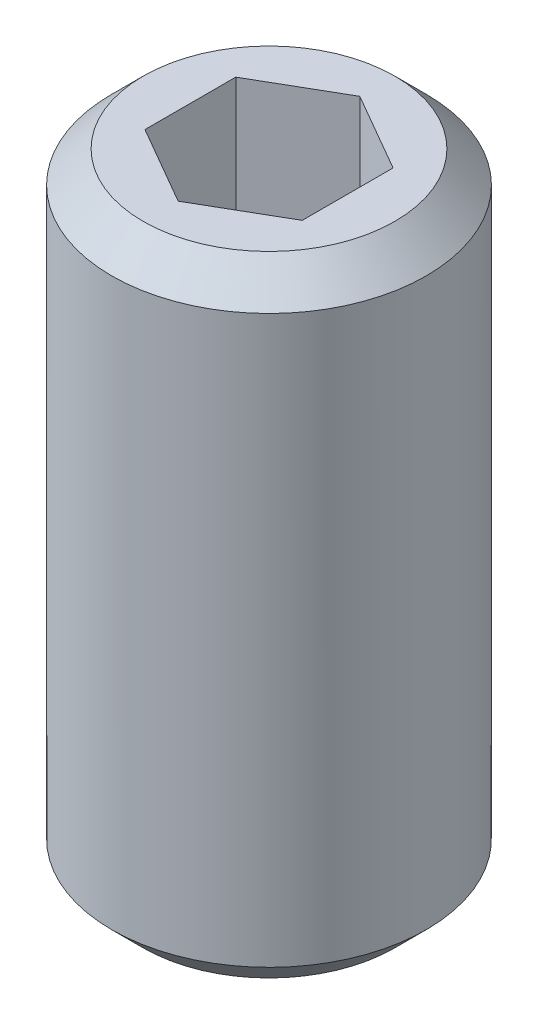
ISO-10303-21;
HEADER;
FILE_DESCRIPTION(('STEP AP214'),'2;1');
FILE_NAME('part.step','',(''),(''),'','','');
FILE_SCHEMA(('AUTOMOTIVE_DESIGN { 1 0 10303 214 1 1 1 1 }'));
ENDSEC;
DATA;
#1=APPLICATION_CONTEXT('core data for automotive mechanical design processes');
#2=APPLICATION_PROTOCOL_DEFINITION('international standard','automotive_design',2000,#1);
#3=PRODUCT_CONTEXT('',#1,'mechanical');
#4=PRODUCT('Part','Part','',(#3));
#5=PRODUCT_RELATED_PRODUCT_CATEGORY('part','',(#4));
#6=PRODUCT_DEFINITION_FORMATION('','',#4);
#7=PRODUCT_DEFINITION_CONTEXT('part definition',#1,'design');
#8=PRODUCT_DEFINITION('design','',#6,#7);
#9=PRODUCT_DEFINITION_SHAPE('','',#8);
#10=(LENGTH_UNIT() NAMED_UNIT(*) SI_UNIT(.MILLI.,.METRE.));
#11=(NAMED_UNIT(*) PLANE_ANGLE_UNIT() SI_UNIT($,.RADIAN.));
#12=(NAMED_UNIT(*) SI_UNIT($,.STERADIAN.) SOLID_ANGLE_UNIT());
#13=UNCERTAINTY_MEASURE_WITH_UNIT(LENGTH_MEASURE(1.E-05),#10,'distance_accuracy_value','');
#14=(GEOMETRIC_REPRESENTATION_CONTEXT(3) GLOBAL_UNCERTAINTY_ASSIGNED_CONTEXT((#13)) GLOBAL_UNIT_ASSIGNED_CONTEXT((#10,
#11,#12)) REPRESENTATION_CONTEXT('',''));
#15=CARTESIAN_POINT('',(0.,0.,0.));
#16=DIRECTION('',(0.,0.,1.));
#17=DIRECTION('',(1.,0.,0.));
#18=AXIS2_PLACEMENT_3D('',#15,#16,#17);
#19=CARTESIAN_POINT('',(0.,-16.,0.));
#20=DIRECTION('',(0.,1.,0.));
#21=DIRECTION('',(0.,0.,1.));
#22=AXIS2_PLACEMENT_3D('',#19,#20,#21);
#23=PLANE('',#22);
#24=CARTESIAN_POINT('',(0.,-16.,0.));
#25=DIRECTION('',(0.,1.,0.));
#26=DIRECTION('',(0.,0.,1.));
#27=AXIS2_PLACEMENT_3D('',#24,#25,#26);
#28=CIRCLE('',#27,3.2);
#29=CARTESIAN_POINT('',(0.,-16.,3.2));
#30=VERTEX_POINT('',#29);
#31=EDGE_CURVE('E147',#30,#30,#28,.F.);
#32=ORIENTED_EDGE('',*,*,#31,.T.);
#33=EDGE_LOOP('',(#32));
#34=FACE_BOUND('',#33,.T.);
#35=ADVANCED_FACE('F37',(#34),#23,.F.);
#36=CARTESIAN_POINT('',(0.,0.,0.));
#37=DIRECTION('',(0.,1.,0.));
#38=DIRECTION('',(0.,0.,1.));
#39=AXIS2_PLACEMENT_3D('',#36,#37,#38);
#40=CYLINDRICAL_SURFACE('',#39,4.);
#41=CARTESIAN_POINT('',(0.,-0.800000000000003,0.));
#42=DIRECTION('',(0.,-1.,0.));
#43=DIRECTION('',(0.,0.,-1.));
#44=AXIS2_PLACEMENT_3D('',#41,#42,#43);
#45=CIRCLE('',#44,4.);
#46=CARTESIAN_POINT('',(0.,-0.800000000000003,-4.));
#47=VERTEX_POINT('',#46);
#48=EDGE_CURVE('E11',#47,#47,#45,.T.);
#49=ORIENTED_EDGE('',*,*,#48,.T.);
#50=EDGE_LOOP('',(#49));
#51=FACE_BOUND('',#50,.T.);
#52=CARTESIAN_POINT('',(0.,-15.2,0.));
#53=DIRECTION('',(0.,1.,0.));
#54=DIRECTION('',(0.,0.,1.));
#55=AXIS2_PLACEMENT_3D('',#52,#53,#54);
#56=CIRCLE('',#55,4.);
#57=CARTESIAN_POINT('',(0.,-15.2,4.));
#58=VERTEX_POINT('',#57);
#59=EDGE_CURVE('E139',#58,#58,#56,.T.);
#60=ORIENTED_EDGE('',*,*,#59,.T.);
#61=EDGE_LOOP('',(#60));
#62=FACE_BOUND('',#61,.T.);
#63=ADVANCED_FACE('F167',(#51,#62),#40,.T.);
#64=CARTESIAN_POINT('',(0.,0.,0.));
#65=DIRECTION('',(0.,-1.,0.));
#66=DIRECTION('',(0.,0.,-1.));
#67=AXIS2_PLACEMENT_3D('',#64,#65,#66);
#68=PLANE('',#67);
#69=DIRECTION('',(0.866025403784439,0.,-0.5));
#70=VECTOR('',#69,1.);
#71=CARTESIAN_POINT('',(0.,0.,2.3094010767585));
#72=LINE('',#71,#70);
#73=CARTESIAN_POINT('',(0.,0.,2.3094010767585));
#74=VERTEX_POINT('',#73);
#75=CARTESIAN_POINT('',(2.,0.,1.15470053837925));
#76=VERTEX_POINT('',#75);
#77=EDGE_CURVE('E126',#74,#76,#72,.T.);
#78=ORIENTED_EDGE('',*,*,#77,.F.);
#79=DIRECTION('',(0.866025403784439,0.,0.5));
#80=VECTOR('',#79,1.);
#81=CARTESIAN_POINT('',(-2.,0.,1.15470053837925));
#82=LINE('',#81,#80);
#83=CARTESIAN_POINT('',(-2.,0.,1.15470053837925));
#84=VERTEX_POINT('',#83);
#85=EDGE_CURVE('E52',#84,#74,#82,.T.);
#86=ORIENTED_EDGE('',*,*,#85,.F.);
#87=DIRECTION('',(0.,0.,1.));
#88=VECTOR('',#87,1.);
#89=CARTESIAN_POINT('',(-2.,0.,-1.15470053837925));
#90=LINE('',#89,#88);
#91=CARTESIAN_POINT('',(-2.,0.,-1.15470053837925));
#92=VERTEX_POINT('',#91);
#93=EDGE_CURVE('E135',#92,#84,#90,.T.);
#94=ORIENTED_EDGE('',*,*,#93,.F.);
#95=DIRECTION('',(-0.866025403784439,0.,0.5));
#96=VECTOR('',#95,1.);
#97=CARTESIAN_POINT('',(0.,0.,-2.3094010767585));
#98=LINE('',#97,#96);
#99=CARTESIAN_POINT('',(0.,0.,-2.3094010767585));
#100=VERTEX_POINT('',#99);
#101=EDGE_CURVE('E133',#100,#92,#98,.T.);
#102=ORIENTED_EDGE('',*,*,#101,.F.);
#103=DIRECTION('',(-0.866025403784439,0.,-0.5));
#104=VECTOR('',#103,1.);
#105=CARTESIAN_POINT('',(2.,0.,-1.15470053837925));
#106=LINE('',#105,#104);
#107=CARTESIAN_POINT('',(2.,0.,-1.15470053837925));
#108=VERTEX_POINT('',#107);
#109=EDGE_CURVE('E100',#108,#100,#106,.T.);
#110=ORIENTED_EDGE('',*,*,#109,.F.);
#111=DIRECTION('',(0.,0.,-1.));
#112=VECTOR('',#111,1.);
#113=CARTESIAN_POINT('',(2.,0.,1.15470053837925));
#114=LINE('',#113,#112);
#115=EDGE_CURVE('E129',#76,#108,#114,.T.);
#116=ORIENTED_EDGE('',*,*,#115,.F.);
#117=EDGE_LOOP('',(#78,#86,#94,#102,#110,#116));
#118=FACE_BOUND('',#117,.T.);
#119=CARTESIAN_POINT('',(0.,0.,0.));
#120=DIRECTION('',(0.,-1.,0.));
#121=DIRECTION('',(0.,0.,-1.));
#122=AXIS2_PLACEMENT_3D('',#119,#120,#121);
#123=CIRCLE('',#122,3.2);
#124=CARTESIAN_POINT('',(0.,0.,-3.2));
#125=VERTEX_POINT('',#124);
#126=EDGE_CURVE('E45',#125,#125,#123,.F.);
#127=ORIENTED_EDGE('',*,*,#126,.T.);
#128=EDGE_LOOP('',(#127));
#129=FACE_BOUND('',#128,.T.);
#130=ADVANCED_FACE('F152',(#118,#129),#68,.F.);
#131=CARTESIAN_POINT('',(0.,-15.2,0.));
#132=DIRECTION('',(0.,1.,0.));
#133=DIRECTION('',(0.,0.,1.));
#134=AXIS2_PLACEMENT_3D('',#131,#132,#133);
#135=CONICAL_SURFACE('',#134,4.,0.78539816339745);
#136=CARTESIAN_POINT('',(0.,-16.,3.2));
#137=CARTESIAN_POINT('',(0.,-15.9916666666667,3.20833333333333));
#138=CARTESIAN_POINT('',(0.,-15.9833333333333,3.21666666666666));
#139=CARTESIAN_POINT('',(0.,-15.9666666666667,3.23333333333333));
#140=CARTESIAN_POINT('',(0.,-15.9583333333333,3.24166666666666));
#141=CARTESIAN_POINT('',(0.,-15.9416666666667,3.25833333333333));
#142=CARTESIAN_POINT('',(0.,-15.9333333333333,3.26666666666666));
#143=CARTESIAN_POINT('',(0.,-15.9166666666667,3.28333333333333));
#144=CARTESIAN_POINT('',(0.,-15.9083333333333,3.29166666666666));
#145=CARTESIAN_POINT('',(0.,-15.8916666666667,3.30833333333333));
#146=CARTESIAN_POINT('',(0.,-15.8833333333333,3.31666666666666));
#147=CARTESIAN_POINT('',(0.,-15.8666666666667,3.33333333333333));
#148=CARTESIAN_POINT('',(0.,-15.8583333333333,3.34166666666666));
#149=CARTESIAN_POINT('',(0.,-15.8416666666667,3.35833333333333));
#150=CARTESIAN_POINT('',(0.,-15.8333333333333,3.36666666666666));
#151=CARTESIAN_POINT('',(0.,-15.8166666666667,3.38333333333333));
#152=CARTESIAN_POINT('',(0.,-15.8083333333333,3.39166666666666));
#153=CARTESIAN_POINT('',(0.,-15.7916666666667,3.40833333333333));
#154=CARTESIAN_POINT('',(0.,-15.7833333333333,3.41666666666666));
#155=CARTESIAN_POINT('',(0.,-15.7666666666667,3.43333333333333));
#156=CARTESIAN_POINT('',(0.,-15.7583333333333,3.44166666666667));
#157=CARTESIAN_POINT('',(0.,-15.7416666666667,3.45833333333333));
#158=CARTESIAN_POINT('',(0.,-15.7333333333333,3.46666666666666));
#159=CARTESIAN_POINT('',(0.,-15.7166666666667,3.48333333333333));
#160=CARTESIAN_POINT('',(0.,-15.7083333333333,3.49166666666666));
#161=CARTESIAN_POINT('',(0.,-15.6916666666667,3.50833333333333));
#162=CARTESIAN_POINT('',(0.,-15.6833333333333,3.51666666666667));
#163=CARTESIAN_POINT('',(0.,-15.6666666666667,3.53333333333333));
#164=CARTESIAN_POINT('',(0.,-15.6583333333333,3.54166666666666));
#165=CARTESIAN_POINT('',(0.,-15.6416666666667,3.55833333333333));
#166=CARTESIAN_POINT('',(0.,-15.6333333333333,3.56666666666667));
#167=CARTESIAN_POINT('',(0.,-15.6166666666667,3.58333333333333));
#168=CARTESIAN_POINT('',(0.,-15.6083333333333,3.59166666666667));
#169=CARTESIAN_POINT('',(0.,-15.5916666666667,3.60833333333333));
#170=CARTESIAN_POINT('',(0.,-15.5833333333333,3.61666666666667));
#171=CARTESIAN_POINT('',(0.,-15.5666666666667,3.63333333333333));
#172=CARTESIAN_POINT('',(0.,-15.5583333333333,3.64166666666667));
#173=CARTESIAN_POINT('',(0.,-15.5416666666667,3.65833333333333));
#174=CARTESIAN_POINT('',(0.,-15.5333333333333,3.66666666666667));
#175=CARTESIAN_POINT('',(0.,-15.5166666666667,3.68333333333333));
#176=CARTESIAN_POINT('',(0.,-15.5083333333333,3.69166666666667));
#177=CARTESIAN_POINT('',(0.,-15.4916666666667,3.70833333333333));
#178=CARTESIAN_POINT('',(0.,-15.4833333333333,3.71666666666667));
#179=CARTESIAN_POINT('',(0.,-15.4666666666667,3.73333333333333));
#180=CARTESIAN_POINT('',(0.,-15.4583333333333,3.74166666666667));
#181=CARTESIAN_POINT('',(0.,-15.4416666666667,3.75833333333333));
#182=CARTESIAN_POINT('',(0.,-15.4333333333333,3.76666666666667));
#183=CARTESIAN_POINT('',(0.,-15.4166666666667,3.78333333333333));
#184=CARTESIAN_POINT('',(0.,-15.4083333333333,3.79166666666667));
#185=CARTESIAN_POINT('',(0.,-15.3916666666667,3.80833333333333));
#186=CARTESIAN_POINT('',(0.,-15.3833333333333,3.81666666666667));
#187=CARTESIAN_POINT('',(0.,-15.3666666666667,3.83333333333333));
#188=CARTESIAN_POINT('',(0.,-15.3583333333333,3.84166666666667));
#189=CARTESIAN_POINT('',(0.,-15.3416666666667,3.85833333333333));
#190=CARTESIAN_POINT('',(0.,-15.3333333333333,3.86666666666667));
#191=CARTESIAN_POINT('',(0.,-15.3166666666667,3.88333333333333));
#192=CARTESIAN_POINT('',(0.,-15.3083333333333,3.89166666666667));
#193=CARTESIAN_POINT('',(0.,-15.2916666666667,3.90833333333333));
#194=CARTESIAN_POINT('',(0.,-15.2833333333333,3.91666666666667));
#195=CARTESIAN_POINT('',(0.,-15.2666666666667,3.93333333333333));
#196=CARTESIAN_POINT('',(0.,-15.2583333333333,3.94166666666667));
#197=CARTESIAN_POINT('',(0.,-15.2416666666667,3.95833333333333));
#198=CARTESIAN_POINT('',(0.,-15.2333333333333,3.96666666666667));
#199=CARTESIAN_POINT('',(0.,-15.2166666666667,3.98333333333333));
#200=CARTESIAN_POINT('',(0.,-15.2083333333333,3.99166666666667));
#201=CARTESIAN_POINT('',(0.,-15.2,4.));
#202=B_SPLINE_CURVE_WITH_KNOTS('',3,(#136,#137,#138,#139,#140,#141,#142,#143,#144,#145,#146,
#147,#148,#149,#150,#151,#152,#153,#154,#155,#156,#157,#158,#159,#160,#161,#162,#163,#164,#165,
#166,#167,#168,#169,#170,#171,#172,#173,#174,#175,#176,#177,#178,#179,#180,#181,#182,#183,#184,
#185,#186,#187,#188,#189,#190,#191,#192,#193,#194,#195,#196,#197,#198,#199,#200,#201),
.UNSPECIFIED.,.F.,.F.,(4,2,2,2,2,2,2,2,2,2,2,2,2,2,2,2,2,2,2,2,2,2,2,2,2,2,2,2,2,2,2,2,4),(0.,
0.0353553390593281,0.0707106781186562,0.106066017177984,0.141421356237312,0.176776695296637,
0.212132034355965,0.247487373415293,0.282842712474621,0.318198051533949,0.353553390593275,
0.388908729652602,0.424264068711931,0.459619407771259,0.494974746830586,0.530330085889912,
0.56568542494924,0.601040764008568,0.636396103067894,0.671751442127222,0.70710678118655,
0.742462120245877,0.777817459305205,0.813172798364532,0.84852813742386,0.883883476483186,
0.919238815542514,0.954594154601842,0.989949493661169,1.0253048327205,1.06066017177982,
1.09601551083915,1.13137084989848),.UNSPECIFIED.);
#203=EDGE_CURVE('BSEAM156',#30,#58,#202,.T.);
#204=ORIENTED_EDGE('',*,*,#31,.F.);
#205=ORIENTED_EDGE('',*,*,#59,.F.);
#206=ORIENTED_EDGE('',*,*,#203,.T.);
#207=ORIENTED_EDGE('',*,*,#203,.F.);
#208=EDGE_LOOP('',(#204,#206,#205,#207));
#209=FACE_BOUND('',#208,.T.);
#210=ADVANCED_FACE('F156',(#209),#135,.T.);
#211=CARTESIAN_POINT('',(0.,0.,0.));
#212=DIRECTION('',(0.,-1.,0.));
#213=DIRECTION('',(0.,0.,-1.));
#214=AXIS2_PLACEMENT_3D('',#211,#212,#213);
#215=CONICAL_SURFACE('',#214,3.2,0.785398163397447);
#216=ORIENTED_EDGE('',*,*,#48,.F.);
#217=EDGE_LOOP('',(#216));
#218=FACE_BOUND('',#217,.T.);
#219=ORIENTED_EDGE('',*,*,#126,.F.);
#220=EDGE_LOOP('',(#219));
#221=FACE_BOUND('',#220,.T.);
#222=ADVANCED_FACE('F39',(#218,#221),#215,.T.);
#223=CARTESIAN_POINT('',(-2.,-5.,1.15470053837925));
#224=DIRECTION('',(-0.5,0.,0.866025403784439));
#225=DIRECTION('',(0.866025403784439,0.,0.5));
#226=AXIS2_PLACEMENT_3D('',#223,#224,#225);
#227=PLANE('',#226);
#228=ORIENTED_EDGE('',*,*,#85,.T.);
#229=DIRECTION('',(0.,1.,0.));
#230=VECTOR('',#229,1.);
#231=CARTESIAN_POINT('',(0.,-5.,2.3094010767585));
#232=LINE('',#231,#230);
#233=CARTESIAN_POINT('',(0.,-5.,2.3094010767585));
#234=VERTEX_POINT('',#233);
#235=EDGE_CURVE('E82',#234,#74,#232,.T.);
#236=ORIENTED_EDGE('',*,*,#235,.F.);
#237=DIRECTION('',(0.866025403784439,0.,0.5));
#238=VECTOR('',#237,1.);
#239=CARTESIAN_POINT('',(-2.,-5.,1.15470053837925));
#240=LINE('',#239,#238);
#241=CARTESIAN_POINT('',(-2.,-5.,1.15470053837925));
#242=VERTEX_POINT('',#241);
#243=EDGE_CURVE('E137',#242,#234,#240,.T.);
#244=ORIENTED_EDGE('',*,*,#243,.F.);
#245=DIRECTION('',(0.,1.,0.));
#246=VECTOR('',#245,1.);
#247=CARTESIAN_POINT('',(-2.,-5.,1.15470053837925));
#248=LINE('',#247,#246);
#249=EDGE_CURVE('E60',#242,#84,#248,.T.);
#250=ORIENTED_EDGE('',*,*,#249,.T.);
#251=EDGE_LOOP('',(#228,#236,#244,#250));
#252=FACE_BOUND('',#251,.T.);
#253=ADVANCED_FACE('F155',(#252),#227,.F.);
#254=CARTESIAN_POINT('',(-2.,-5.,-1.15470053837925));
#255=DIRECTION('',(-1.,0.,0.));
#256=DIRECTION('',(0.,0.,1.));
#257=AXIS2_PLACEMENT_3D('',#254,#255,#256);
#258=PLANE('',#257);
#259=ORIENTED_EDGE('',*,*,#93,.T.);
#260=ORIENTED_EDGE('',*,*,#249,.F.);
#261=DIRECTION('',(0.,0.,1.));
#262=VECTOR('',#261,1.);
#263=CARTESIAN_POINT('',(-2.,-5.,-1.15470053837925));
#264=LINE('',#263,#262);
#265=CARTESIAN_POINT('',(-2.,-5.,-1.15470053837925));
#266=VERTEX_POINT('',#265);
#267=EDGE_CURVE('E112',#266,#242,#264,.T.);
#268=ORIENTED_EDGE('',*,*,#267,.F.);
#269=DIRECTION('',(0.,1.,0.));
#270=VECTOR('',#269,1.);
#271=CARTESIAN_POINT('',(-2.,-5.,-1.15470053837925));
#272=LINE('',#271,#270);
#273=EDGE_CURVE('E104',#266,#92,#272,.T.);
#274=ORIENTED_EDGE('',*,*,#273,.T.);
#275=EDGE_LOOP('',(#259,#260,#268,#274));
#276=FACE_BOUND('',#275,.T.);
#277=ADVANCED_FACE('F162',(#276),#258,.F.);
#278=CARTESIAN_POINT('',(0.,-5.,-2.3094010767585));
#279=DIRECTION('',(-0.5,0.,-0.866025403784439));
#280=DIRECTION('',(-0.866025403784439,0.,0.5));
#281=AXIS2_PLACEMENT_3D('',#278,#279,#280);
#282=PLANE('',#281);
#283=ORIENTED_EDGE('',*,*,#101,.T.);
#284=ORIENTED_EDGE('',*,*,#273,.F.);
#285=DIRECTION('',(-0.866025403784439,0.,0.5));
#286=VECTOR('',#285,1.);
#287=CARTESIAN_POINT('',(0.,-5.,-2.3094010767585));
#288=LINE('',#287,#286);
#289=CARTESIAN_POINT('',(0.,-5.,-2.3094010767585));
#290=VERTEX_POINT('',#289);
#291=EDGE_CURVE('E108',#290,#266,#288,.T.);
#292=ORIENTED_EDGE('',*,*,#291,.F.);
#293=DIRECTION('',(0.,1.,0.));
#294=VECTOR('',#293,1.);
#295=CARTESIAN_POINT('',(0.,-5.,-2.3094010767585));
#296=LINE('',#295,#294);
#297=EDGE_CURVE('E93',#290,#100,#296,.T.);
#298=ORIENTED_EDGE('',*,*,#297,.T.);
#299=EDGE_LOOP('',(#283,#284,#292,#298));
#300=FACE_BOUND('',#299,.T.);
#301=ADVANCED_FACE('F109',(#300),#282,.F.);
#302=CARTESIAN_POINT('',(2.,-5.,-1.15470053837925));
#303=DIRECTION('',(0.5,0.,-0.866025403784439));
#304=DIRECTION('',(-0.866025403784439,0.,-0.5));
#305=AXIS2_PLACEMENT_3D('',#302,#303,#304);
#306=PLANE('',#305);
#307=ORIENTED_EDGE('',*,*,#109,.T.);
#308=ORIENTED_EDGE('',*,*,#297,.F.);
#309=DIRECTION('',(-0.866025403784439,0.,-0.5));
#310=VECTOR('',#309,1.);
#311=CARTESIAN_POINT('',(2.,-5.,-1.15470053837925));
#312=LINE('',#311,#310);
#313=CARTESIAN_POINT('',(2.,-5.,-1.15470053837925));
#314=VERTEX_POINT('',#313);
#315=EDGE_CURVE('E97',#314,#290,#312,.T.);
#316=ORIENTED_EDGE('',*,*,#315,.F.);
#317=DIRECTION('',(0.,1.,0.));
#318=VECTOR('',#317,1.);
#319=CARTESIAN_POINT('',(2.,-5.,-1.15470053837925));
#320=LINE('',#319,#318);
#321=EDGE_CURVE('E105',#314,#108,#320,.T.);
#322=ORIENTED_EDGE('',*,*,#321,.T.);
#323=EDGE_LOOP('',(#307,#308,#316,#322));
#324=FACE_BOUND('',#323,.T.);
#325=ADVANCED_FACE('F95',(#324),#306,.F.);
#326=CARTESIAN_POINT('',(2.,-5.,1.15470053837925));
#327=DIRECTION('',(1.,0.,0.));
#328=DIRECTION('',(0.,0.,-1.));
#329=AXIS2_PLACEMENT_3D('',#326,#327,#328);
#330=PLANE('',#329);
#331=ORIENTED_EDGE('',*,*,#115,.T.);
#332=ORIENTED_EDGE('',*,*,#321,.F.);
#333=DIRECTION('',(0.,0.,-1.));
#334=VECTOR('',#333,1.);
#335=CARTESIAN_POINT('',(2.,-5.,1.15470053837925));
#336=LINE('',#335,#334);
#337=CARTESIAN_POINT('',(2.,-5.,1.15470053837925));
#338=VERTEX_POINT('',#337);
#339=EDGE_CURVE('E118',#338,#314,#336,.T.);
#340=ORIENTED_EDGE('',*,*,#339,.F.);
#341=DIRECTION('',(0.,1.,0.));
#342=VECTOR('',#341,1.);
#343=CARTESIAN_POINT('',(2.,-5.,1.15470053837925));
#344=LINE('',#343,#342);
#345=EDGE_CURVE('E142',#338,#76,#344,.T.);
#346=ORIENTED_EDGE('',*,*,#345,.T.);
#347=EDGE_LOOP('',(#331,#332,#340,#346));
#348=FACE_BOUND('',#347,.T.);
#349=ADVANCED_FACE('F182',(#348),#330,.F.);
#350=CARTESIAN_POINT('',(0.,-5.,2.3094010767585));
#351=DIRECTION('',(0.5,0.,0.866025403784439));
#352=DIRECTION('',(0.866025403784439,0.,-0.5));
#353=AXIS2_PLACEMENT_3D('',#350,#351,#352);
#354=PLANE('',#353);
#355=ORIENTED_EDGE('',*,*,#77,.T.);
#356=ORIENTED_EDGE('',*,*,#345,.F.);
#357=DIRECTION('',(0.866025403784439,0.,-0.5));
#358=VECTOR('',#357,1.);
#359=CARTESIAN_POINT('',(0.,-5.,2.3094010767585));
#360=LINE('',#359,#358);
#361=EDGE_CURVE('E120',#234,#338,#360,.T.);
#362=ORIENTED_EDGE('',*,*,#361,.F.);
#363=ORIENTED_EDGE('',*,*,#235,.T.);
#364=EDGE_LOOP('',(#355,#356,#362,#363));
#365=FACE_BOUND('',#364,.T.);
#366=ADVANCED_FACE('F179',(#365),#354,.F.);
#367=CARTESIAN_POINT('',(2.,-5.,3.46410161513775));
#368=DIRECTION('',(0.,1.,0.));
#369=DIRECTION('',(0.,0.,1.));
#370=AXIS2_PLACEMENT_3D('',#367,#368,#369);
#371=PLANE('',#370);
#372=ORIENTED_EDGE('',*,*,#243,.T.);
#373=ORIENTED_EDGE('',*,*,#361,.T.);
#374=ORIENTED_EDGE('',*,*,#339,.T.);
#375=ORIENTED_EDGE('',*,*,#315,.T.);
#376=ORIENTED_EDGE('',*,*,#291,.T.);
#377=ORIENTED_EDGE('',*,*,#267,.T.);
#378=EDGE_LOOP('',(#372,#373,#374,#375,#376,#377));
#379=FACE_BOUND('',#378,.T.);
#380=ADVANCED_FACE('F115',(#379),#371,.T.);
#381=CLOSED_SHELL('',(#35,#63,#130,#210,#222,#253,#277,#301,#325,#349,#366,#380));
#382=MANIFOLD_SOLID_BREP('B2',#381);
#383=ADVANCED_BREP_SHAPE_REPRESENTATION('',(#18,#382),#14);
#384=SHAPE_DEFINITION_REPRESENTATION(#9,#383);
ENDSEC;
END-ISO-10303-21;
